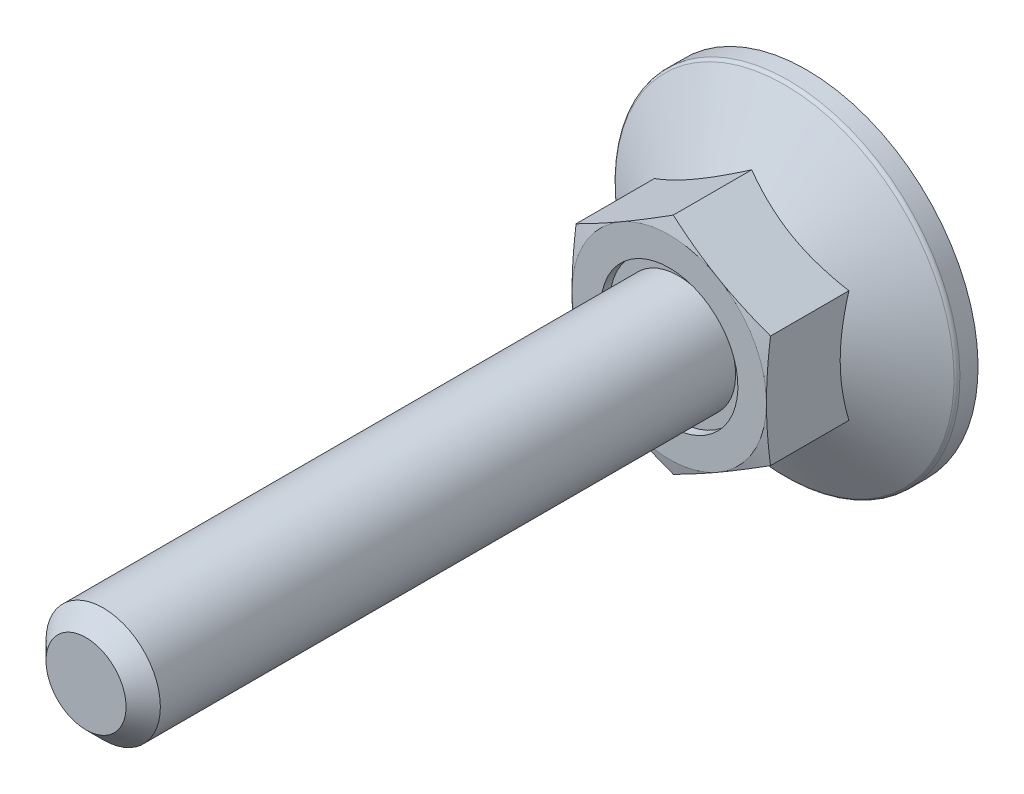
ISO-10303-21;
HEADER;
FILE_DESCRIPTION(('STEP AP214'),'2;1');
FILE_NAME('part.step','',(''),(''),'','','');
FILE_SCHEMA(('AUTOMOTIVE_DESIGN { 1 0 10303 214 1 1 1 1 }'));
ENDSEC;
DATA;
#1=APPLICATION_CONTEXT('core data for automotive mechanical design processes');
#2=APPLICATION_PROTOCOL_DEFINITION('international standard','automotive_design',2000,#1);
#3=PRODUCT_CONTEXT('',#1,'mechanical');
#4=PRODUCT('Part','Part','',(#3));
#5=PRODUCT_RELATED_PRODUCT_CATEGORY('part','',(#4));
#6=PRODUCT_DEFINITION_FORMATION('','',#4);
#7=PRODUCT_DEFINITION_CONTEXT('part definition',#1,'design');
#8=PRODUCT_DEFINITION('design','',#6,#7);
#9=PRODUCT_DEFINITION_SHAPE('','',#8);
#10=(LENGTH_UNIT() NAMED_UNIT(*) SI_UNIT(.MILLI.,.METRE.));
#11=(NAMED_UNIT(*) PLANE_ANGLE_UNIT() SI_UNIT($,.RADIAN.));
#12=(NAMED_UNIT(*) SI_UNIT($,.STERADIAN.) SOLID_ANGLE_UNIT());
#13=UNCERTAINTY_MEASURE_WITH_UNIT(LENGTH_MEASURE(1.E-05),#10,'distance_accuracy_value','');
#14=(GEOMETRIC_REPRESENTATION_CONTEXT(3) GLOBAL_UNCERTAINTY_ASSIGNED_CONTEXT((#13)) GLOBAL_UNIT_ASSIGNED_CONTEXT((#10,
#11,#12)) REPRESENTATION_CONTEXT('',''));
#15=CARTESIAN_POINT('',(0.,0.,0.));
#16=DIRECTION('',(0.,0.,1.));
#17=DIRECTION('',(1.,0.,0.));
#18=AXIS2_PLACEMENT_3D('',#15,#16,#17);
#19=CARTESIAN_POINT('',(0.,0.,11.2));
#20=DIRECTION('',(0.,0.,-1.));
#21=DIRECTION('',(0.,1.,0.));
#22=AXIS2_PLACEMENT_3D('',#19,#20,#21);
#23=PLANE('',#22);
#24=CARTESIAN_POINT('',(0.,0.,11.2));
#25=DIRECTION('',(0.,0.,-1.));
#26=DIRECTION('',(0.,1.,0.));
#27=AXIS2_PLACEMENT_3D('',#24,#25,#26);
#28=CIRCLE('',#27,6.);
#29=CARTESIAN_POINT('',(0.,6.,11.2));
#30=VERTEX_POINT('',#29);
#31=EDGE_CURVE('E108',#30,#30,#28,.T.);
#32=ORIENTED_EDGE('',*,*,#31,.F.);
#33=EDGE_LOOP('',(#32));
#34=FACE_BOUND('',#33,.T.);
#35=CARTESIAN_POINT('',(0.,0.,11.2));
#36=DIRECTION('',(0.,0.,-1.));
#37=DIRECTION('',(0.,1.,0.));
#38=AXIS2_PLACEMENT_3D('',#35,#36,#37);
#39=CIRCLE('',#38,5.);
#40=CARTESIAN_POINT('',(0.,5.,11.2));
#41=VERTEX_POINT('',#40);
#42=EDGE_CURVE('E259',#41,#41,#39,.F.);
#43=ORIENTED_EDGE('',*,*,#42,.F.);
#44=EDGE_LOOP('',(#43));
#45=FACE_BOUND('',#44,.T.);
#46=ADVANCED_FACE('F14',(#34,#45),#23,.F.);
#47=CARTESIAN_POINT('',(0.,9.81495457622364,32.));
#48=DIRECTION('',(0.5,-0.866025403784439,0.));
#49=DIRECTION('',(0.866025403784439,0.5,0.));
#50=AXIS2_PLACEMENT_3D('',#47,#48,#49);
#51=PLANE('',#50);
#52=CARTESIAN_POINT('',(-8.5002,4.90736181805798,4.7935207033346));
#53=CARTESIAN_POINT('',(-8.31336077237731,5.01523349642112,4.85579061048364));
#54=CARTESIAN_POINT('',(-8.1258249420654,5.1235073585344,4.91523445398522));
#55=CARTESIAN_POINT('',(-7.74923024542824,5.34093440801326,5.02769163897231));
#56=CARTESIAN_POINT('',(-7.56017075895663,5.45008795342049,5.08070220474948));
#57=CARTESIAN_POINT('',(-6.9899652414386,5.77929626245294,5.22904336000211));
#58=CARTESIAN_POINT('',(-6.60656835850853,6.00065055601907,5.31341782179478));
#59=CARTESIAN_POINT('',(-6.03282233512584,6.33190297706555,5.41235673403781));
#60=CARTESIAN_POINT('',(-5.84418723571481,6.44081150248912,5.44054155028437));
#61=CARTESIAN_POINT('',(-5.46606397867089,6.65912106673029,5.48780266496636));
#62=CARTESIAN_POINT('',(-5.27657589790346,6.76852206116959,5.5068797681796));
#63=CARTESIAN_POINT('',(-4.8972734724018,6.98751241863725,5.53544197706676));
#64=CARTESIAN_POINT('',(-4.70745974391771,7.09710142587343,5.54493796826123));
#65=CARTESIAN_POINT('',(-4.32765694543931,7.3163806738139,5.55413437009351));
#66=CARTESIAN_POINT('',(-4.13766788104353,7.42607091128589,5.55383508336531));
#67=CARTESIAN_POINT('',(-3.78247698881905,7.63114046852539,5.54412227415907));
#68=CARTESIAN_POINT('',(-3.6172500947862,7.72653426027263,5.53589358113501));
#69=CARTESIAN_POINT('',(-3.28718328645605,7.9170984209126,5.51218750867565));
#70=CARTESIAN_POINT('',(-3.12234339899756,8.01226877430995,5.49670964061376));
#71=CARTESIAN_POINT('',(-2.62846189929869,8.29741139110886,5.43976812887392));
#72=CARTESIAN_POINT('',(-2.30029449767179,8.48687892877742,5.38780368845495));
#73=CARTESIAN_POINT('',(-1.64047857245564,8.86782383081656,5.25789180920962));
#74=CARTESIAN_POINT('',(-1.30891425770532,9.05925257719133,5.17939367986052));
#75=CARTESIAN_POINT('',(-0.650730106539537,9.43925537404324,5.00123540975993));
#76=CARTESIAN_POINT('',(-0.32410184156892,9.62783429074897,4.90161711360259));
#77=CARTESIAN_POINT('',(0.000200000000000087,9.81507004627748,4.7935207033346));
#78=B_SPLINE_CURVE_WITH_KNOTS('',3,(#52,#53,#54,#55,#56,#57,#58,#59,#60,#61,#62,#63,#64,#65,#66,
#67,#68,#69,#70,#71,#72,#73,#74,#75,#76,#77),.UNSPECIFIED.,.F.,.F.,(4,2,2,2,2,2,2,2,2,2,2,2,4),
(0.,0.673596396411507,1.34748239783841,2.69805431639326,3.356799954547,4.01548737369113,
4.67342558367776,5.33134346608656,5.90409556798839,6.47688628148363,7.62328361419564,
8.79510569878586,9.9646274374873),.UNSPECIFIED.);
#79=CARTESIAN_POINT('',(-8.5,4.90747728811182,4.79358737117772));
#80=VERTEX_POINT('',#79);
#81=CARTESIAN_POINT('',(0.,9.81495457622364,4.79358737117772));
#82=VERTEX_POINT('',#81);
#83=EDGE_CURVE('E97',#80,#82,#78,.T.);
#84=ORIENTED_EDGE('',*,*,#83,.F.);
#85=DIRECTION('',(0.,0.,-1.));
#86=VECTOR('',#85,1.);
#87=CARTESIAN_POINT('',(-8.5,4.90747728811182,32.));
#88=LINE('',#87,#86);
#89=CARTESIAN_POINT('',(-8.5,4.90747728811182,11.6476589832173));
#90=VERTEX_POINT('',#89);
#91=EDGE_CURVE('E86',#90,#80,#88,.T.);
#92=ORIENTED_EDGE('',*,*,#91,.F.);
#93=CARTESIAN_POINT('',(0.000200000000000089,9.81507004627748,11.6476280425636));
#94=CARTESIAN_POINT('',(-0.352800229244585,9.61126526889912,11.7022599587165));
#95=CARTESIAN_POINT('',(-0.706440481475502,9.40709097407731,11.7518566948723));
#96=CARTESIAN_POINT('',(-1.41496987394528,8.99802133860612,11.8389934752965));
#97=CARTESIAN_POINT('',(-1.76985946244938,8.79312573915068,11.8765286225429));
#98=CARTESIAN_POINT('',(-2.47873586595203,8.38385575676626,11.9373509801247));
#99=CARTESIAN_POINT('',(-2.83271788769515,8.17948414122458,11.9607107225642));
#100=CARTESIAN_POINT('',(-3.5411333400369,7.77048028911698,11.9920337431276));
#101=CARTESIAN_POINT('',(-3.89556667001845,7.56584811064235,12.));
#102=CARTESIAN_POINT('',(-4.60443332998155,7.15658375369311,12.));
#103=CARTESIAN_POINT('',(-4.9588666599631,6.95195157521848,11.9920337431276));
#104=CARTESIAN_POINT('',(-5.66728211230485,6.54294772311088,11.9607107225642));
#105=CARTESIAN_POINT('',(-6.02126413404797,6.33857610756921,11.9373509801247));
#106=CARTESIAN_POINT('',(-6.73014053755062,5.92930612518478,11.8765286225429));
#107=CARTESIAN_POINT('',(-7.08503012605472,5.72441052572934,11.8389934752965));
#108=CARTESIAN_POINT('',(-7.7935595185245,5.31534089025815,11.7518566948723));
#109=CARTESIAN_POINT('',(-8.14719977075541,5.11116659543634,11.7022599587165));
#110=CARTESIAN_POINT('',(-8.5002,4.90736181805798,11.6476280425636));
#111=B_SPLINE_CURVE_WITH_KNOTS('',3,(#93,#94,#95,#96,#97,#98,#99,#100,#101,#102,#103,#104,#105,
#106,#107,#108,#109,#110),.UNSPECIFIED.,.F.,.F.,(4,2,2,2,2,2,2,2,4),(0.,1.23382789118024,
2.46815608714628,3.69611406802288,4.92383440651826,6.15155474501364,7.37951272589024,
8.61384092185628,9.84766881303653),.UNSPECIFIED.);
#112=CARTESIAN_POINT('',(-4.25,7.36121593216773,12.));
#113=VERTEX_POINT('',#112);
#114=EDGE_CURVE('E186',#113,#90,#111,.T.);
#115=ORIENTED_EDGE('',*,*,#114,.F.);
#116=CARTESIAN_POINT('',(0.,9.81495457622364,11.6476589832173));
#117=VERTEX_POINT('',#116);
#118=EDGE_CURVE('E318',#117,#113,#111,.T.);
#119=ORIENTED_EDGE('',*,*,#118,.F.);
#120=DIRECTION('',(0.,0.,-1.));
#121=VECTOR('',#120,1.);
#122=CARTESIAN_POINT('',(0.,9.81495457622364,32.));
#123=LINE('',#122,#121);
#124=EDGE_CURVE('E101',#117,#82,#123,.T.);
#125=ORIENTED_EDGE('',*,*,#124,.T.);
#126=EDGE_LOOP('',(#84,#92,#115,#119,#125));
#127=FACE_BOUND('',#126,.T.);
#128=ADVANCED_FACE('F100',(#127),#51,.F.);
#129=CARTESIAN_POINT('',(8.5,4.90747728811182,32.));
#130=DIRECTION('',(-0.5,-0.866025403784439,0.));
#131=DIRECTION('',(0.866025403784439,-0.5,0.));
#132=AXIS2_PLACEMENT_3D('',#129,#130,#131);
#133=PLANE('',#132);
#134=CARTESIAN_POINT('',(-0.0002,9.81507004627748,4.7935207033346));
#135=CARTESIAN_POINT('',(0.186639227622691,9.70719836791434,4.85579061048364));
#136=CARTESIAN_POINT('',(0.374175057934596,9.59892450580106,4.91523445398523));
#137=CARTESIAN_POINT('',(0.750769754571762,9.3814974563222,5.02769163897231));
#138=CARTESIAN_POINT('',(0.939829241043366,9.27234391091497,5.08070220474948));
#139=CARTESIAN_POINT('',(1.5100347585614,8.94313560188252,5.22904336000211));
#140=CARTESIAN_POINT('',(1.89343164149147,8.72178130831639,5.31341782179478));
#141=CARTESIAN_POINT('',(2.46717766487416,8.39052888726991,5.41235673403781));
#142=CARTESIAN_POINT('',(2.65581276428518,8.28162036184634,5.44054155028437));
#143=CARTESIAN_POINT('',(3.03393602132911,8.06331079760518,5.48780266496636));
#144=CARTESIAN_POINT('',(3.22342410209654,7.95390980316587,5.5068797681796));
#145=CARTESIAN_POINT('',(3.6027265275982,7.73491944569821,5.53544197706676));
#146=CARTESIAN_POINT('',(3.79254025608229,7.62533043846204,5.54493796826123));
#147=CARTESIAN_POINT('',(4.17234305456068,7.40605119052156,5.55413437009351));
#148=CARTESIAN_POINT('',(4.36233211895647,7.29636095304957,5.55383508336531));
#149=CARTESIAN_POINT('',(4.71752301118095,7.09129139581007,5.54412227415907));
#150=CARTESIAN_POINT('',(4.8827499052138,6.99589760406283,5.53589358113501));
#151=CARTESIAN_POINT('',(5.21281671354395,6.80533344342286,5.51218750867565));
#152=CARTESIAN_POINT('',(5.37765660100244,6.71016309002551,5.49670964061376));
#153=CARTESIAN_POINT('',(5.87153810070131,6.42502047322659,5.43976812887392));
#154=CARTESIAN_POINT('',(6.19970550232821,6.23555293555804,5.38780368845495));
#155=CARTESIAN_POINT('',(6.85952142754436,5.8546080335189,5.25789180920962));
#156=CARTESIAN_POINT('',(7.19108574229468,5.66317928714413,5.17939367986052));
#157=CARTESIAN_POINT('',(7.84926989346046,5.28317649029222,5.00123540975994));
#158=CARTESIAN_POINT('',(8.17589815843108,5.09459757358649,4.90161711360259));
#159=CARTESIAN_POINT('',(8.5002,4.90736181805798,4.7935207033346));
#160=B_SPLINE_CURVE_WITH_KNOTS('',3,(#134,#135,#136,#137,#138,#139,#140,#141,#142,#143,#144,
#145,#146,#147,#148,#149,#150,#151,#152,#153,#154,#155,#156,#157,#158,#159),.UNSPECIFIED.,.F.,
.F.,(4,2,2,2,2,2,2,2,2,2,2,2,4),(0.,0.673596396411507,1.34748239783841,2.69805431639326,
3.356799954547,4.01548737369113,4.67342558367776,5.33134346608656,5.90409556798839,
6.47688628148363,7.62328361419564,8.79510569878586,9.9646274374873),.UNSPECIFIED.);
#161=CARTESIAN_POINT('',(8.5,4.90747728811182,4.79358737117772));
#162=VERTEX_POINT('',#161);
#163=EDGE_CURVE('E29',#82,#162,#160,.T.);
#164=ORIENTED_EDGE('',*,*,#163,.F.);
#165=ORIENTED_EDGE('',*,*,#124,.F.);
#166=CARTESIAN_POINT('',(8.5002,4.90736181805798,11.6476280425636));
#167=CARTESIAN_POINT('',(8.14719977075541,5.11116659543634,11.7022599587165));
#168=CARTESIAN_POINT('',(7.7935595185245,5.31534089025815,11.7518566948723));
#169=CARTESIAN_POINT('',(7.08503012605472,5.72441052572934,11.8389934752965));
#170=CARTESIAN_POINT('',(6.73014053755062,5.92930612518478,11.8765286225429));
#171=CARTESIAN_POINT('',(6.02126413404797,6.33857610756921,11.9373509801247));
#172=CARTESIAN_POINT('',(5.66728211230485,6.54294772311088,11.9607107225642));
#173=CARTESIAN_POINT('',(4.9588666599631,6.95195157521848,11.9920337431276));
#174=CARTESIAN_POINT('',(4.60443332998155,7.15658375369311,12.));
#175=CARTESIAN_POINT('',(3.89556667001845,7.56584811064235,12.));
#176=CARTESIAN_POINT('',(3.5411333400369,7.77048028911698,11.9920337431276));
#177=CARTESIAN_POINT('',(2.83271788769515,8.17948414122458,11.9607107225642));
#178=CARTESIAN_POINT('',(2.47873586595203,8.38385575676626,11.9373509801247));
#179=CARTESIAN_POINT('',(1.76985946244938,8.79312573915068,11.8765286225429));
#180=CARTESIAN_POINT('',(1.41496987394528,8.99802133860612,11.8389934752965));
#181=CARTESIAN_POINT('',(0.706440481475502,9.40709097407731,11.7518566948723));
#182=CARTESIAN_POINT('',(0.352800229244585,9.61126526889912,11.7022599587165));
#183=CARTESIAN_POINT('',(-0.000200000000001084,9.81507004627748,11.6476280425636));
#184=B_SPLINE_CURVE_WITH_KNOTS('',3,(#166,#167,#168,#169,#170,#171,#172,#173,#174,#175,#176,
#177,#178,#179,#180,#181,#182,#183),.UNSPECIFIED.,.F.,.F.,(4,2,2,2,2,2,2,2,4),(0.,
1.23382789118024,2.46815608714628,3.69611406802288,4.92383440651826,6.15155474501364,
7.37951272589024,8.61384092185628,9.84766881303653),.UNSPECIFIED.);
#185=CARTESIAN_POINT('',(4.25,7.36121593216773,12.));
#186=VERTEX_POINT('',#185);
#187=EDGE_CURVE('E177',#186,#117,#184,.T.);
#188=ORIENTED_EDGE('',*,*,#187,.F.);
#189=CARTESIAN_POINT('',(8.5,4.90747728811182,11.6476589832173));
#190=VERTEX_POINT('',#189);
#191=EDGE_CURVE('E184',#190,#186,#184,.T.);
#192=ORIENTED_EDGE('',*,*,#191,.F.);
#193=DIRECTION('',(0.,0.,-1.));
#194=VECTOR('',#193,1.);
#195=CARTESIAN_POINT('',(8.5,4.90747728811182,32.));
#196=LINE('',#195,#194);
#197=EDGE_CURVE('E216',#190,#162,#196,.T.);
#198=ORIENTED_EDGE('',*,*,#197,.T.);
#199=EDGE_LOOP('',(#164,#165,#188,#192,#198));
#200=FACE_BOUND('',#199,.T.);
#201=ADVANCED_FACE('F192',(#200),#133,.F.);
#202=CARTESIAN_POINT('',(8.5,-4.90747728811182,32.));
#203=DIRECTION('',(-1.,0.,0.));
#204=DIRECTION('',(0.,-1.,0.));
#205=AXIS2_PLACEMENT_3D('',#202,#203,#204);
#206=PLANE('',#205);
#207=CARTESIAN_POINT('',(8.5,13.0314294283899,1.47752704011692));
#208=CARTESIAN_POINT('',(8.5,12.6612665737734,1.65647774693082));
#209=CARTESIAN_POINT('',(8.5,12.290237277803,1.83366776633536));
#210=CARTESIAN_POINT('',(8.5,11.5459841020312,2.1835324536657));
#211=CARTESIAN_POINT('',(8.5,11.1727598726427,2.3562063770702));
#212=CARTESIAN_POINT('',(8.5,10.4216603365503,2.69694543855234));
#213=CARTESIAN_POINT('',(8.5,10.0437706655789,2.86497902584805));
#214=CARTESIAN_POINT('',(8.5,9.2849306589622,3.19396010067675));
#215=CARTESIAN_POINT('',(8.5,8.90398047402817,3.35490793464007));
#216=CARTESIAN_POINT('',(8.5,8.12702308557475,3.67249615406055));
#217=CARTESIAN_POINT('',(8.5,7.73090483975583,3.82886642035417));
#218=CARTESIAN_POINT('',(8.5,6.93398073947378,4.12940330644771));
#219=CARTESIAN_POINT('',(8.5,6.53317435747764,4.27356853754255));
#220=CARTESIAN_POINT('',(8.5,5.72703031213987,4.54580160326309));
#221=CARTESIAN_POINT('',(8.5,5.32170421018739,4.67390329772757));
#222=CARTESIAN_POINT('',(8.5,4.50525785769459,4.90980359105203));
#223=CARTESIAN_POINT('',(8.5,4.09413952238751,5.01760873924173));
#224=CARTESIAN_POINT('',(8.5,3.26789885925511,5.20711197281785));
#225=CARTESIAN_POINT('',(8.5,2.85280627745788,5.28893618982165));
#226=CARTESIAN_POINT('',(8.5,2.22651264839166,5.38853539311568));
#227=CARTESIAN_POINT('',(8.5,2.01712321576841,5.41788026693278));
#228=CARTESIAN_POINT('',(8.5,1.59735566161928,5.46827917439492));
#229=CARTESIAN_POINT('',(8.5,1.38697763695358,5.48933400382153));
#230=CARTESIAN_POINT('',(8.5,0.968196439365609,5.52247691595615));
#231=CARTESIAN_POINT('',(8.5,0.759802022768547,5.53467524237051));
#232=CARTESIAN_POINT('',(8.5,0.342684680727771,5.55026003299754));
#233=CARTESIAN_POINT('',(8.5,0.133961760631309,5.5536466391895));
#234=CARTESIAN_POINT('',(8.5,-0.283445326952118,5.55152742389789));
#235=CARTESIAN_POINT('',(8.5,-0.492129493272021,5.546021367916));
#236=CARTESIAN_POINT('',(8.5,-0.909085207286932,5.52624824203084));
#237=CARTESIAN_POINT('',(8.5,-1.11735673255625,5.51198070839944));
#238=CARTESIAN_POINT('',(8.5,-1.62231800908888,5.46706351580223));
#239=CARTESIAN_POINT('',(8.5,-1.91862399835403,5.43201243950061));
#240=CARTESIAN_POINT('',(8.5,-2.50892471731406,5.34612267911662));
#241=CARTESIAN_POINT('',(8.5,-2.80291910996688,5.29528173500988));
#242=CARTESIAN_POINT('',(8.5,-3.68114216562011,5.12178025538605));
#243=CARTESIAN_POINT('',(8.5,-4.26128126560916,4.97817413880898));
#244=CARTESIAN_POINT('',(8.5,-5.12903133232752,4.73045572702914));
#245=CARTESIAN_POINT('',(8.5,-5.42116721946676,4.64129591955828));
#246=CARTESIAN_POINT('',(8.5,-6.0025970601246,4.45406394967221));
#247=CARTESIAN_POINT('',(8.5,-6.29189099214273,4.35599171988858));
#248=CARTESIAN_POINT('',(8.5,-6.86774141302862,4.15248019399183));
#249=CARTESIAN_POINT('',(8.5,-7.15429879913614,4.0470434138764));
#250=CARTESIAN_POINT('',(8.5,-7.72505625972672,3.83000899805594));
#251=CARTESIAN_POINT('',(8.5,-8.00925638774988,3.71841150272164));
#252=CARTESIAN_POINT('',(8.5,-8.7865968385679,3.40502511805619));
#253=CARTESIAN_POINT('',(8.5,-9.2776226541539,3.197996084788));
#254=CARTESIAN_POINT('',(8.5,-10.2546964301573,2.77246752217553));
#255=CARTESIAN_POINT('',(8.5,-10.7407438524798,2.55396676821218));
#256=CARTESIAN_POINT('',(8.5,-11.7090438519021,2.108282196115));
#257=CARTESIAN_POINT('',(8.5,-12.1912949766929,1.88109523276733));
#258=CARTESIAN_POINT('',(8.5,-13.1526185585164,1.42016244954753));
#259=CARTESIAN_POINT('',(8.5,-13.6316911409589,1.18641689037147));
#260=CARTESIAN_POINT('',(8.5,-14.588034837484,0.713462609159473));
#261=CARTESIAN_POINT('',(8.5,-15.0653020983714,0.47424611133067));
#262=CARTESIAN_POINT('',(8.5,-16.0177905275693,-0.00822936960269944));
#263=CARTESIAN_POINT('',(8.5,-16.4930116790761,-0.251488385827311));
#264=CARTESIAN_POINT('',(8.5,-17.4416812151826,-0.741191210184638));
#265=CARTESIAN_POINT('',(8.5,-17.9151299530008,-0.987634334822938));
#266=CARTESIAN_POINT('',(8.5,-18.8606492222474,-1.48315179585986));
#267=CARTESIAN_POINT('',(8.5,-19.3327197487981,-1.73222614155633));
#268=CARTESIAN_POINT('',(8.5,-20.6461392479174,-2.42904815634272));
#269=CARTESIAN_POINT('',(8.5,-21.4862394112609,-2.87914918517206));
#270=CARTESIAN_POINT('',(8.5,-23.1638169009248,-3.78432075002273));
#271=CARTESIAN_POINT('',(8.5,-24.0012940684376,-4.23939157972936));
#272=CARTESIAN_POINT('',(8.5,-25.671623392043,-5.15180725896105));
#273=CARTESIAN_POINT('',(8.5,-26.5044818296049,-5.60914061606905));
#274=CARTESIAN_POINT('',(8.5,-27.7525740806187,-6.29723391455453));
#275=CARTESIAN_POINT('',(8.5,-28.1683903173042,-6.52693873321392));
#276=CARTESIAN_POINT('',(8.5,-28.9996764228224,-6.98697325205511));
#277=CARTESIAN_POINT('',(8.5,-29.4151462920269,-7.21730295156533));
#278=CARTESIAN_POINT('',(8.5,-29.8304643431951,-7.44790614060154));
#279=B_SPLINE_CURVE_WITH_KNOTS('',3,(#207,#208,#209,#210,#211,#212,#213,#214,#215,#216,#217,
#218,#219,#220,#221,#222,#223,#224,#225,#226,#227,#228,#229,#230,#231,#232,#233,#234,#235,#236,
#237,#238,#239,#240,#241,#242,#243,#244,#245,#246,#247,#248,#249,#250,#251,#252,#253,#254,#255,
#256,#257,#258,#259,#260,#261,#262,#263,#264,#265,#266,#267,#268,#269,#270,#271,#272,#273,#274,
#275,#276,#277,#278),.UNSPECIFIED.,.F.,.F.,(4,2,2,2,2,2,2,2,2,2,2,2,2,2,2,2,2,2,2,2,2,2,2,2,2,2,
2,2,2,2,2,2,2,2,2,4),(0.,1.23346428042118,2.46713064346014,3.70776702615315,4.94834268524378,
6.22578289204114,7.5033682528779,8.77821366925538,10.0526470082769,11.32079515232,
11.9549638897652,12.5890717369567,13.2151443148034,13.8412068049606,14.4672858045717,
15.0933979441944,15.9880059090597,16.8827419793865,18.6732029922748,19.5894472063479,
20.5056983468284,21.4216379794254,22.3375567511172,23.9359919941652,25.5345982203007,
27.1337888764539,28.7329160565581,30.3344778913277,31.9360528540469,33.5372895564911,
35.1385319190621,37.9977422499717,40.8571224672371,43.7075995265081,45.1327331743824,
46.5578652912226),.UNSPECIFIED.);
#280=CARTESIAN_POINT('',(8.5,-4.90747728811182,4.79358737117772));
#281=VERTEX_POINT('',#280);
#282=EDGE_CURVE('E37',#162,#281,#279,.T.);
#283=ORIENTED_EDGE('',*,*,#282,.F.);
#284=ORIENTED_EDGE('',*,*,#197,.F.);
#285=CARTESIAN_POINT('',(8.5,12.9820891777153,10.1197370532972));
#286=CARTESIAN_POINT('',(8.5,12.5964686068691,10.2061594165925));
#287=CARTESIAN_POINT('',(8.5,12.2106068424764,10.2915248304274));
#288=CARTESIAN_POINT('',(8.5,11.4382824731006,10.4595712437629));
#289=CARTESIAN_POINT('',(8.5,11.0518198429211,10.5422521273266));
#290=CARTESIAN_POINT('',(8.5,10.2778290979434,10.7044309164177));
#291=CARTESIAN_POINT('',(8.5,9.89030030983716,10.7839256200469));
#292=CARTESIAN_POINT('',(8.5,9.11443612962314,10.9388739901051));
#293=CARTESIAN_POINT('',(8.5,8.72610074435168,11.0143276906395));
#294=CARTESIAN_POINT('',(8.5,7.95158013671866,11.159650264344));
#295=CARTESIAN_POINT('',(8.5,7.56540239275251,11.2295587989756));
#296=CARTESIAN_POINT('',(8.5,6.79199352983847,11.3632725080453));
#297=CARTESIAN_POINT('',(8.5,6.40476243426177,11.4270778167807));
#298=CARTESIAN_POINT('',(8.5,5.62917169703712,11.54714843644));
#299=CARTESIAN_POINT('',(8.5,5.24081220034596,11.6034146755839));
#300=CARTESIAN_POINT('',(8.5,4.46285737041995,11.70674908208));
#301=CARTESIAN_POINT('',(8.5,4.07326203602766,11.7538172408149));
#302=CARTESIAN_POINT('',(8.5,3.28844017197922,11.8374226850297));
#303=CARTESIAN_POINT('',(8.5,2.89320002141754,11.8738340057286));
#304=CARTESIAN_POINT('',(8.5,2.10172608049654,11.9336139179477));
#305=CARTESIAN_POINT('',(8.5,1.70549231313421,11.9569828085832));
#306=CARTESIAN_POINT('',(8.5,0.91260591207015,11.9893148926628));
#307=CARTESIAN_POINT('',(8.5,0.515953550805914,11.9982846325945));
#308=CARTESIAN_POINT('',(8.5,-0.277408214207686,12.0012669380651));
#309=CARTESIAN_POINT('',(8.5,-0.674117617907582,11.9952795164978));
#310=CARTESIAN_POINT('',(8.5,-1.46847963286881,11.9686842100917));
#311=CARTESIAN_POINT('',(8.5,-1.86613043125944,11.9480232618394));
#312=CARTESIAN_POINT('',(8.5,-2.66049684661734,11.8932602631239));
#313=CARTESIAN_POINT('',(8.5,-3.05721244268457,11.8591579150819));
#314=CARTESIAN_POINT('',(8.5,-3.84970511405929,11.7792347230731));
#315=CARTESIAN_POINT('',(8.5,-4.24548140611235,11.7334062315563));
#316=CARTESIAN_POINT('',(8.5,-5.03576028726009,11.6319377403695));
#317=CARTESIAN_POINT('',(8.5,-5.43026287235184,11.5762977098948));
#318=CARTESIAN_POINT('',(8.5,-6.19195385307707,11.4609360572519));
#319=CARTESIAN_POINT('',(8.5,-6.55922094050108,11.4017287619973));
#320=CARTESIAN_POINT('',(8.5,-7.29278719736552,11.2775674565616));
#321=CARTESIAN_POINT('',(8.5,-7.65908634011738,11.2126132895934));
#322=CARTESIAN_POINT('',(8.5,-8.39085027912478,11.078008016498));
#323=CARTESIAN_POINT('',(8.5,-8.75631499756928,11.0083564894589));
#324=CARTESIAN_POINT('',(8.5,-9.48649515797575,10.8652200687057));
#325=CARTESIAN_POINT('',(8.5,-9.85121059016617,10.7917351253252));
#326=CARTESIAN_POINT('',(8.5,-10.5800753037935,10.6416087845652));
#327=CARTESIAN_POINT('',(8.5,-10.944224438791,10.5649666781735));
#328=CARTESIAN_POINT('',(8.5,-11.6719684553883,10.4090909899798));
#329=CARTESIAN_POINT('',(8.5,-12.0355633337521,10.3298573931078));
#330=CARTESIAN_POINT('',(8.5,-13.1255915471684,10.0889686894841));
#331=CARTESIAN_POINT('',(8.5,-13.8513178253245,9.92411536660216));
#332=CARTESIAN_POINT('',(8.5,-15.2942598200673,9.59010912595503));
#333=CARTESIAN_POINT('',(8.5,-16.0114890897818,9.42101437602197));
#334=CARTESIAN_POINT('',(8.5,-17.4449475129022,9.07858755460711));
#335=CARTESIAN_POINT('',(8.5,-18.1611766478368,8.90525540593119));
#336=CARTESIAN_POINT('',(8.5,-19.5919856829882,8.5556799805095));
#337=CARTESIAN_POINT('',(8.5,-20.306566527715,8.37944056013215));
#338=CARTESIAN_POINT('',(8.5,-21.7351057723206,8.02455520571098));
#339=CARTESIAN_POINT('',(8.5,-22.4490641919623,7.8459093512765));
#340=CARTESIAN_POINT('',(8.5,-23.1628057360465,7.66641079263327));
#341=B_SPLINE_CURVE_WITH_KNOTS('',3,(#285,#286,#287,#288,#289,#290,#291,#292,#293,#294,#295,
#296,#297,#298,#299,#300,#301,#302,#303,#304,#305,#306,#307,#308,#309,#310,#311,#312,#313,#314,
#315,#316,#317,#318,#319,#320,#321,#322,#323,#324,#325,#326,#327,#328,#329,#330,#331,#332,#333,
#334,#335,#336,#337,#338,#339,#340),.UNSPECIFIED.,.F.,.F.,(4,2,2,2,2,2,2,2,2,2,2,2,2,2,2,2,2,2,
2,2,2,2,2,2,2,2,2,4),(0.,1.18556310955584,2.37117735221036,3.55795462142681,4.74472187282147,
5.92204594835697,7.09934411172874,8.27649719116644,9.45365137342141,10.6442044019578,
11.8347301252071,13.0247144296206,14.2146977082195,15.4090063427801,16.6033414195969,
17.7984574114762,18.9935771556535,20.1095500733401,21.2255534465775,22.3416569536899,
23.4577749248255,24.5741449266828,25.6905214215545,27.9231231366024,30.1337863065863,
32.3444897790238,34.5524651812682,36.7603677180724),.UNSPECIFIED.);
#342=CARTESIAN_POINT('',(8.5,0.,12.));
#343=VERTEX_POINT('',#342);
#344=EDGE_CURVE('E170',#343,#190,#341,.F.);
#345=ORIENTED_EDGE('',*,*,#344,.F.);
#346=CARTESIAN_POINT('',(8.5,-4.90747728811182,11.6476589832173));
#347=VERTEX_POINT('',#346);
#348=EDGE_CURVE('E185',#347,#343,#341,.F.);
#349=ORIENTED_EDGE('',*,*,#348,.F.);
#350=DIRECTION('',(0.,0.,-1.));
#351=VECTOR('',#350,1.);
#352=CARTESIAN_POINT('',(8.5,-4.90747728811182,32.));
#353=LINE('',#352,#351);
#354=EDGE_CURVE('E218',#347,#281,#353,.T.);
#355=ORIENTED_EDGE('',*,*,#354,.T.);
#356=EDGE_LOOP('',(#283,#284,#345,#349,#355));
#357=FACE_BOUND('',#356,.T.);
#358=ADVANCED_FACE('F195',(#357),#206,.F.);
#359=CARTESIAN_POINT('',(0.,-9.81495457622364,32.));
#360=DIRECTION('',(-0.5,0.866025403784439,0.));
#361=DIRECTION('',(-0.866025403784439,-0.5,0.));
#362=AXIS2_PLACEMENT_3D('',#359,#360,#361);
#363=PLANE('',#362);
#364=CARTESIAN_POINT('',(8.5002,-4.90736181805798,4.7935207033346));
#365=CARTESIAN_POINT('',(8.31336077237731,-5.01523349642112,4.85579061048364));
#366=CARTESIAN_POINT('',(8.1258249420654,-5.1235073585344,4.91523445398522));
#367=CARTESIAN_POINT('',(7.74923024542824,-5.34093440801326,5.02769163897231));
#368=CARTESIAN_POINT('',(7.56017075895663,-5.45008795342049,5.08070220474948));
#369=CARTESIAN_POINT('',(6.9899652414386,-5.77929626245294,5.22904336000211));
#370=CARTESIAN_POINT('',(6.60656835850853,-6.00065055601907,5.31341782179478));
#371=CARTESIAN_POINT('',(6.03282233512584,-6.33190297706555,5.41235673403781));
#372=CARTESIAN_POINT('',(5.84418723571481,-6.44081150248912,5.44054155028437));
#373=CARTESIAN_POINT('',(5.46606397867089,-6.65912106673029,5.48780266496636));
#374=CARTESIAN_POINT('',(5.27657589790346,-6.76852206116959,5.5068797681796));
#375=CARTESIAN_POINT('',(4.8972734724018,-6.98751241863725,5.53544197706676));
#376=CARTESIAN_POINT('',(4.70745974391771,-7.09710142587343,5.54493796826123));
#377=CARTESIAN_POINT('',(4.32765694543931,-7.3163806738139,5.55413437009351));
#378=CARTESIAN_POINT('',(4.13766788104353,-7.42607091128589,5.55383508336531));
#379=CARTESIAN_POINT('',(3.78247698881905,-7.63114046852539,5.54412227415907));
#380=CARTESIAN_POINT('',(3.6172500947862,-7.72653426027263,5.53589358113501));
#381=CARTESIAN_POINT('',(3.28718328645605,-7.9170984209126,5.51218750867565));
#382=CARTESIAN_POINT('',(3.12234339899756,-8.01226877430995,5.49670964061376));
#383=CARTESIAN_POINT('',(2.62846189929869,-8.29741139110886,5.43976812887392));
#384=CARTESIAN_POINT('',(2.30029449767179,-8.48687892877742,5.38780368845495));
#385=CARTESIAN_POINT('',(1.64047857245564,-8.86782383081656,5.25789180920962));
#386=CARTESIAN_POINT('',(1.30891425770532,-9.05925257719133,5.17939367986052));
#387=CARTESIAN_POINT('',(0.650730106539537,-9.43925537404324,5.00123540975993));
#388=CARTESIAN_POINT('',(0.32410184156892,-9.62783429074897,4.90161711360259));
#389=CARTESIAN_POINT('',(-0.000200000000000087,-9.81507004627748,4.7935207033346));
#390=B_SPLINE_CURVE_WITH_KNOTS('',3,(#364,#365,#366,#367,#368,#369,#370,#371,#372,#373,#374,
#375,#376,#377,#378,#379,#380,#381,#382,#383,#384,#385,#386,#387,#388,#389),.UNSPECIFIED.,.F.,
.F.,(4,2,2,2,2,2,2,2,2,2,2,2,4),(0.,0.673596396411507,1.34748239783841,2.69805431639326,
3.356799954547,4.01548737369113,4.67342558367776,5.33134346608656,5.90409556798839,
6.47688628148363,7.62328361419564,8.79510569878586,9.9646274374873),.UNSPECIFIED.);
#391=CARTESIAN_POINT('',(0.,-9.81495457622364,4.79358737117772));
#392=VERTEX_POINT('',#391);
#393=EDGE_CURVE('E276',#281,#392,#390,.T.);
#394=ORIENTED_EDGE('',*,*,#393,.F.);
#395=ORIENTED_EDGE('',*,*,#354,.F.);
#396=CARTESIAN_POINT('',(-0.000200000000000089,-9.81507004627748,11.6476280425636));
#397=CARTESIAN_POINT('',(0.352800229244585,-9.61126526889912,11.7022599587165));
#398=CARTESIAN_POINT('',(0.706440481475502,-9.40709097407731,11.7518566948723));
#399=CARTESIAN_POINT('',(1.41496987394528,-8.99802133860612,11.8389934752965));
#400=CARTESIAN_POINT('',(1.76985946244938,-8.79312573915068,11.8765286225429));
#401=CARTESIAN_POINT('',(2.47873586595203,-8.38385575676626,11.9373509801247));
#402=CARTESIAN_POINT('',(2.83271788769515,-8.17948414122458,11.9607107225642));
#403=CARTESIAN_POINT('',(3.5411333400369,-7.77048028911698,11.9920337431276));
#404=CARTESIAN_POINT('',(3.89556667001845,-7.56584811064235,12.));
#405=CARTESIAN_POINT('',(4.60443332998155,-7.15658375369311,12.));
#406=CARTESIAN_POINT('',(4.9588666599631,-6.95195157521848,11.9920337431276));
#407=CARTESIAN_POINT('',(5.66728211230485,-6.54294772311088,11.9607107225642));
#408=CARTESIAN_POINT('',(6.02126413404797,-6.33857610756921,11.9373509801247));
#409=CARTESIAN_POINT('',(6.73014053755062,-5.92930612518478,11.8765286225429));
#410=CARTESIAN_POINT('',(7.08503012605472,-5.72441052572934,11.8389934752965));
#411=CARTESIAN_POINT('',(7.7935595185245,-5.31534089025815,11.7518566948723));
#412=CARTESIAN_POINT('',(8.14719977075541,-5.11116659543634,11.7022599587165));
#413=CARTESIAN_POINT('',(8.5002,-4.90736181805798,11.6476280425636));
#414=B_SPLINE_CURVE_WITH_KNOTS('',3,(#396,#397,#398,#399,#400,#401,#402,#403,#404,#405,#406,
#407,#408,#409,#410,#411,#412,#413),.UNSPECIFIED.,.F.,.F.,(4,2,2,2,2,2,2,2,4),(0.,
1.23382789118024,2.46815608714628,3.69611406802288,4.92383440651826,6.15155474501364,
7.37951272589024,8.61384092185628,9.84766881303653),.UNSPECIFIED.);
#415=CARTESIAN_POINT('',(4.25,-7.36121593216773,12.));
#416=VERTEX_POINT('',#415);
#417=EDGE_CURVE('E164',#416,#347,#414,.T.);
#418=ORIENTED_EDGE('',*,*,#417,.F.);
#419=CARTESIAN_POINT('',(0.,-9.81495457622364,11.6476589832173));
#420=VERTEX_POINT('',#419);
#421=EDGE_CURVE('E299',#420,#416,#414,.T.);
#422=ORIENTED_EDGE('',*,*,#421,.F.);
#423=DIRECTION('',(0.,0.,-1.));
#424=VECTOR('',#423,1.);
#425=CARTESIAN_POINT('',(0.,-9.81495457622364,32.));
#426=LINE('',#425,#424);
#427=EDGE_CURVE('E220',#420,#392,#426,.T.);
#428=ORIENTED_EDGE('',*,*,#427,.T.);
#429=EDGE_LOOP('',(#394,#395,#418,#422,#428));
#430=FACE_BOUND('',#429,.T.);
#431=ADVANCED_FACE('F281',(#430),#363,.F.);
#432=CARTESIAN_POINT('',(-8.5,-4.90747728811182,32.));
#433=DIRECTION('',(0.5,0.866025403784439,0.));
#434=DIRECTION('',(-0.866025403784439,0.5,0.));
#435=AXIS2_PLACEMENT_3D('',#432,#433,#434);
#436=PLANE('',#435);
#437=CARTESIAN_POINT('',(0.0002,-9.81507004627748,4.7935207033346));
#438=CARTESIAN_POINT('',(-0.186639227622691,-9.70719836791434,4.85579061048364));
#439=CARTESIAN_POINT('',(-0.374175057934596,-9.59892450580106,4.91523445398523));
#440=CARTESIAN_POINT('',(-0.750769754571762,-9.3814974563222,5.02769163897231));
#441=CARTESIAN_POINT('',(-0.939829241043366,-9.27234391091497,5.08070220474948));
#442=CARTESIAN_POINT('',(-1.5100347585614,-8.94313560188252,5.22904336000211));
#443=CARTESIAN_POINT('',(-1.89343164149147,-8.72178130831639,5.31341782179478));
#444=CARTESIAN_POINT('',(-2.46717766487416,-8.39052888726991,5.41235673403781));
#445=CARTESIAN_POINT('',(-2.65581276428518,-8.28162036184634,5.44054155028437));
#446=CARTESIAN_POINT('',(-3.03393602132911,-8.06331079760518,5.48780266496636));
#447=CARTESIAN_POINT('',(-3.22342410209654,-7.95390980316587,5.5068797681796));
#448=CARTESIAN_POINT('',(-3.6027265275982,-7.73491944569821,5.53544197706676));
#449=CARTESIAN_POINT('',(-3.79254025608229,-7.62533043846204,5.54493796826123));
#450=CARTESIAN_POINT('',(-4.17234305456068,-7.40605119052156,5.55413437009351));
#451=CARTESIAN_POINT('',(-4.36233211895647,-7.29636095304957,5.55383508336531));
#452=CARTESIAN_POINT('',(-4.71752301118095,-7.09129139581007,5.54412227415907));
#453=CARTESIAN_POINT('',(-4.8827499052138,-6.99589760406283,5.53589358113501));
#454=CARTESIAN_POINT('',(-5.21281671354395,-6.80533344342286,5.51218750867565));
#455=CARTESIAN_POINT('',(-5.37765660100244,-6.71016309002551,5.49670964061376));
#456=CARTESIAN_POINT('',(-5.87153810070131,-6.42502047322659,5.43976812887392));
#457=CARTESIAN_POINT('',(-6.19970550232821,-6.23555293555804,5.38780368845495));
#458=CARTESIAN_POINT('',(-6.85952142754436,-5.8546080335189,5.25789180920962));
#459=CARTESIAN_POINT('',(-7.19108574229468,-5.66317928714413,5.17939367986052));
#460=CARTESIAN_POINT('',(-7.84926989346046,-5.28317649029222,5.00123540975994));
#461=CARTESIAN_POINT('',(-8.17589815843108,-5.09459757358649,4.90161711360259));
#462=CARTESIAN_POINT('',(-8.5002,-4.90736181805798,4.7935207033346));
#463=B_SPLINE_CURVE_WITH_KNOTS('',3,(#437,#438,#439,#440,#441,#442,#443,#444,#445,#446,#447,
#448,#449,#450,#451,#452,#453,#454,#455,#456,#457,#458,#459,#460,#461,#462),.UNSPECIFIED.,.F.,
.F.,(4,2,2,2,2,2,2,2,2,2,2,2,4),(0.,0.673596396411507,1.34748239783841,2.69805431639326,
3.356799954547,4.01548737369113,4.67342558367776,5.33134346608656,5.90409556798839,
6.47688628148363,7.62328361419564,8.79510569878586,9.9646274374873),.UNSPECIFIED.);
#464=CARTESIAN_POINT('',(-8.5,-4.90747728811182,4.79358737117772));
#465=VERTEX_POINT('',#464);
#466=EDGE_CURVE('E107',#392,#465,#463,.T.);
#467=ORIENTED_EDGE('',*,*,#466,.F.);
#468=ORIENTED_EDGE('',*,*,#427,.F.);
#469=CARTESIAN_POINT('',(-8.5002,-4.90736181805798,11.6476280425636));
#470=CARTESIAN_POINT('',(-8.14719977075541,-5.11116659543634,11.7022599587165));
#471=CARTESIAN_POINT('',(-7.7935595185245,-5.31534089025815,11.7518566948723));
#472=CARTESIAN_POINT('',(-7.08503012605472,-5.72441052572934,11.8389934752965));
#473=CARTESIAN_POINT('',(-6.73014053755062,-5.92930612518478,11.8765286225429));
#474=CARTESIAN_POINT('',(-6.02126413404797,-6.33857610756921,11.9373509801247));
#475=CARTESIAN_POINT('',(-5.66728211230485,-6.54294772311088,11.9607107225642));
#476=CARTESIAN_POINT('',(-4.9588666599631,-6.95195157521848,11.9920337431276));
#477=CARTESIAN_POINT('',(-4.60443332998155,-7.15658375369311,12.));
#478=CARTESIAN_POINT('',(-3.89556667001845,-7.56584811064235,12.));
#479=CARTESIAN_POINT('',(-3.5411333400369,-7.77048028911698,11.9920337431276));
#480=CARTESIAN_POINT('',(-2.83271788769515,-8.17948414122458,11.9607107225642));
#481=CARTESIAN_POINT('',(-2.47873586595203,-8.38385575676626,11.9373509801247));
#482=CARTESIAN_POINT('',(-1.76985946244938,-8.79312573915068,11.8765286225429));
#483=CARTESIAN_POINT('',(-1.41496987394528,-8.99802133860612,11.8389934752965));
#484=CARTESIAN_POINT('',(-0.706440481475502,-9.40709097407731,11.7518566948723));
#485=CARTESIAN_POINT('',(-0.352800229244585,-9.61126526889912,11.7022599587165));
#486=CARTESIAN_POINT('',(0.000200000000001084,-9.81507004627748,11.6476280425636));
#487=B_SPLINE_CURVE_WITH_KNOTS('',3,(#469,#470,#471,#472,#473,#474,#475,#476,#477,#478,#479,
#480,#481,#482,#483,#484,#485,#486),.UNSPECIFIED.,.F.,.F.,(4,2,2,2,2,2,2,2,4),(0.,
1.23382789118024,2.46815608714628,3.69611406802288,4.92383440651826,6.15155474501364,
7.37951272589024,8.61384092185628,9.84766881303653),.UNSPECIFIED.);
#488=CARTESIAN_POINT('',(-4.25,-7.36121593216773,12.));
#489=VERTEX_POINT('',#488);
#490=EDGE_CURVE('E144',#489,#420,#487,.T.);
#491=ORIENTED_EDGE('',*,*,#490,.F.);
#492=CARTESIAN_POINT('',(-8.5,-4.90747728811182,11.6476589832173));
#493=VERTEX_POINT('',#492);
#494=EDGE_CURVE('E226',#493,#489,#487,.T.);
#495=ORIENTED_EDGE('',*,*,#494,.F.);
#496=DIRECTION('',(0.,0.,-1.));
#497=VECTOR('',#496,1.);
#498=CARTESIAN_POINT('',(-8.5,-4.90747728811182,32.));
#499=LINE('',#498,#497);
#500=EDGE_CURVE('E96',#493,#465,#499,.T.);
#501=ORIENTED_EDGE('',*,*,#500,.T.);
#502=EDGE_LOOP('',(#467,#468,#491,#495,#501));
#503=FACE_BOUND('',#502,.T.);
#504=ADVANCED_FACE('F129',(#503),#436,.F.);
#505=CARTESIAN_POINT('',(-8.5,4.90747728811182,32.));
#506=DIRECTION('',(1.,0.,0.));
#507=DIRECTION('',(0.,1.,0.));
#508=AXIS2_PLACEMENT_3D('',#505,#506,#507);
#509=PLANE('',#508);
#510=CARTESIAN_POINT('',(-8.5,13.0314294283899,1.47752704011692));
#511=CARTESIAN_POINT('',(-8.5,12.6612665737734,1.65647774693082));
#512=CARTESIAN_POINT('',(-8.5,12.290237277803,1.83366776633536));
#513=CARTESIAN_POINT('',(-8.5,11.5459841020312,2.1835324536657));
#514=CARTESIAN_POINT('',(-8.5,11.1727598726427,2.3562063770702));
#515=CARTESIAN_POINT('',(-8.5,10.4216603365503,2.69694543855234));
#516=CARTESIAN_POINT('',(-8.5,10.0437706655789,2.86497902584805));
#517=CARTESIAN_POINT('',(-8.5,9.2849306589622,3.19396010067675));
#518=CARTESIAN_POINT('',(-8.5,8.90398047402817,3.35490793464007));
#519=CARTESIAN_POINT('',(-8.5,8.12702308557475,3.67249615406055));
#520=CARTESIAN_POINT('',(-8.5,7.73090483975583,3.82886642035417));
#521=CARTESIAN_POINT('',(-8.5,6.93398073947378,4.12940330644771));
#522=CARTESIAN_POINT('',(-8.5,6.53317435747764,4.27356853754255));
#523=CARTESIAN_POINT('',(-8.5,5.72703031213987,4.54580160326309));
#524=CARTESIAN_POINT('',(-8.5,5.32170421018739,4.67390329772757));
#525=CARTESIAN_POINT('',(-8.5,4.50525785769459,4.90980359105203));
#526=CARTESIAN_POINT('',(-8.5,4.09413952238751,5.01760873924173));
#527=CARTESIAN_POINT('',(-8.5,3.26789885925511,5.20711197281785));
#528=CARTESIAN_POINT('',(-8.5,2.85280627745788,5.28893618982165));
#529=CARTESIAN_POINT('',(-8.5,2.22651264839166,5.38853539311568));
#530=CARTESIAN_POINT('',(-8.5,2.01712321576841,5.41788026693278));
#531=CARTESIAN_POINT('',(-8.5,1.59735566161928,5.46827917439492));
#532=CARTESIAN_POINT('',(-8.5,1.38697763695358,5.48933400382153));
#533=CARTESIAN_POINT('',(-8.5,0.968196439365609,5.52247691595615));
#534=CARTESIAN_POINT('',(-8.5,0.759802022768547,5.53467524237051));
#535=CARTESIAN_POINT('',(-8.5,0.342684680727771,5.55026003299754));
#536=CARTESIAN_POINT('',(-8.5,0.133961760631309,5.5536466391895));
#537=CARTESIAN_POINT('',(-8.5,-0.283445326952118,5.55152742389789));
#538=CARTESIAN_POINT('',(-8.5,-0.492129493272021,5.546021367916));
#539=CARTESIAN_POINT('',(-8.5,-0.909085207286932,5.52624824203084));
#540=CARTESIAN_POINT('',(-8.5,-1.11735673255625,5.51198070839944));
#541=CARTESIAN_POINT('',(-8.5,-1.62231800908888,5.46706351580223));
#542=CARTESIAN_POINT('',(-8.5,-1.91862399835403,5.43201243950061));
#543=CARTESIAN_POINT('',(-8.5,-2.50892471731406,5.34612267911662));
#544=CARTESIAN_POINT('',(-8.5,-2.80291910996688,5.29528173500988));
#545=CARTESIAN_POINT('',(-8.5,-3.68114216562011,5.12178025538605));
#546=CARTESIAN_POINT('',(-8.5,-4.26128126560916,4.97817413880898));
#547=CARTESIAN_POINT('',(-8.5,-5.12903133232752,4.73045572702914));
#548=CARTESIAN_POINT('',(-8.5,-5.42116721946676,4.64129591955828));
#549=CARTESIAN_POINT('',(-8.5,-6.0025970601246,4.45406394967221));
#550=CARTESIAN_POINT('',(-8.5,-6.29189099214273,4.35599171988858));
#551=CARTESIAN_POINT('',(-8.5,-6.86774141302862,4.15248019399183));
#552=CARTESIAN_POINT('',(-8.5,-7.15429879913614,4.0470434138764));
#553=CARTESIAN_POINT('',(-8.5,-7.72505625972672,3.83000899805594));
#554=CARTESIAN_POINT('',(-8.5,-8.00925638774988,3.71841150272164));
#555=CARTESIAN_POINT('',(-8.5,-8.7865968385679,3.40502511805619));
#556=CARTESIAN_POINT('',(-8.5,-9.2776226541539,3.197996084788));
#557=CARTESIAN_POINT('',(-8.5,-10.2546964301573,2.77246752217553));
#558=CARTESIAN_POINT('',(-8.5,-10.7407438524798,2.55396676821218));
#559=CARTESIAN_POINT('',(-8.5,-11.7090438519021,2.108282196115));
#560=CARTESIAN_POINT('',(-8.5,-12.1912949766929,1.88109523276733));
#561=CARTESIAN_POINT('',(-8.5,-13.1526185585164,1.42016244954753));
#562=CARTESIAN_POINT('',(-8.5,-13.6316911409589,1.18641689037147));
#563=CARTESIAN_POINT('',(-8.5,-14.588034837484,0.713462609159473));
#564=CARTESIAN_POINT('',(-8.5,-15.0653020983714,0.47424611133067));
#565=CARTESIAN_POINT('',(-8.5,-16.0177905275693,-0.00822936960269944));
#566=CARTESIAN_POINT('',(-8.5,-16.4930116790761,-0.251488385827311));
#567=CARTESIAN_POINT('',(-8.5,-17.4416812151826,-0.741191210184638));
#568=CARTESIAN_POINT('',(-8.5,-17.9151299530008,-0.987634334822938));
#569=CARTESIAN_POINT('',(-8.5,-18.8606492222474,-1.48315179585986));
#570=CARTESIAN_POINT('',(-8.5,-19.3327197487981,-1.73222614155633));
#571=CARTESIAN_POINT('',(-8.5,-20.6461392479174,-2.42904815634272));
#572=CARTESIAN_POINT('',(-8.5,-21.4862394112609,-2.87914918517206));
#573=CARTESIAN_POINT('',(-8.5,-23.1638169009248,-3.78432075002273));
#574=CARTESIAN_POINT('',(-8.5,-24.0012940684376,-4.23939157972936));
#575=CARTESIAN_POINT('',(-8.5,-25.671623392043,-5.15180725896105));
#576=CARTESIAN_POINT('',(-8.5,-26.5044818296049,-5.60914061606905));
#577=CARTESIAN_POINT('',(-8.5,-27.7525740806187,-6.29723391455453));
#578=CARTESIAN_POINT('',(-8.5,-28.1683903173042,-6.52693873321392));
#579=CARTESIAN_POINT('',(-8.5,-28.9996764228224,-6.98697325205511));
#580=CARTESIAN_POINT('',(-8.5,-29.4151462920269,-7.21730295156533));
#581=CARTESIAN_POINT('',(-8.5,-29.8304643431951,-7.44790614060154));
#582=B_SPLINE_CURVE_WITH_KNOTS('',3,(#510,#511,#512,#513,#514,#515,#516,#517,#518,#519,#520,
#521,#522,#523,#524,#525,#526,#527,#528,#529,#530,#531,#532,#533,#534,#535,#536,#537,#538,#539,
#540,#541,#542,#543,#544,#545,#546,#547,#548,#549,#550,#551,#552,#553,#554,#555,#556,#557,#558,
#559,#560,#561,#562,#563,#564,#565,#566,#567,#568,#569,#570,#571,#572,#573,#574,#575,#576,#577,
#578,#579,#580,#581),.UNSPECIFIED.,.F.,.F.,(4,2,2,2,2,2,2,2,2,2,2,2,2,2,2,2,2,2,2,2,2,2,2,2,2,2,
2,2,2,2,2,2,2,2,2,4),(0.,1.23346428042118,2.46713064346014,3.70776702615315,4.94834268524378,
6.22578289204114,7.5033682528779,8.77821366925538,10.0526470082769,11.32079515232,
11.9549638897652,12.5890717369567,13.2151443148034,13.8412068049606,14.4672858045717,
15.0933979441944,15.9880059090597,16.8827419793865,18.6732029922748,19.5894472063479,
20.5056983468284,21.4216379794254,22.3375567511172,23.9359919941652,25.5345982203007,
27.1337888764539,28.7329160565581,30.3344778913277,31.9360528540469,33.5372895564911,
35.1385319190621,37.9977422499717,40.8571224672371,43.7075995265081,45.1327331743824,
46.5578652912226),.UNSPECIFIED.);
#583=EDGE_CURVE('E90',#465,#80,#582,.F.);
#584=ORIENTED_EDGE('',*,*,#583,.F.);
#585=ORIENTED_EDGE('',*,*,#500,.F.);
#586=CARTESIAN_POINT('',(-8.5,12.9820891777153,10.1197370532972));
#587=CARTESIAN_POINT('',(-8.5,12.5964686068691,10.2061594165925));
#588=CARTESIAN_POINT('',(-8.5,12.2106068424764,10.2915248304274));
#589=CARTESIAN_POINT('',(-8.5,11.4382824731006,10.4595712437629));
#590=CARTESIAN_POINT('',(-8.5,11.0518198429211,10.5422521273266));
#591=CARTESIAN_POINT('',(-8.5,10.2778290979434,10.7044309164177));
#592=CARTESIAN_POINT('',(-8.5,9.89030030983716,10.7839256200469));
#593=CARTESIAN_POINT('',(-8.5,9.11443612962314,10.9388739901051));
#594=CARTESIAN_POINT('',(-8.5,8.72610074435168,11.0143276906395));
#595=CARTESIAN_POINT('',(-8.5,7.95158013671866,11.159650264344));
#596=CARTESIAN_POINT('',(-8.5,7.56540239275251,11.2295587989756));
#597=CARTESIAN_POINT('',(-8.5,6.79199352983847,11.3632725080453));
#598=CARTESIAN_POINT('',(-8.5,6.40476243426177,11.4270778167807));
#599=CARTESIAN_POINT('',(-8.5,5.62917169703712,11.54714843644));
#600=CARTESIAN_POINT('',(-8.5,5.24081220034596,11.6034146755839));
#601=CARTESIAN_POINT('',(-8.5,4.46285737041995,11.70674908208));
#602=CARTESIAN_POINT('',(-8.5,4.07326203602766,11.7538172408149));
#603=CARTESIAN_POINT('',(-8.5,3.28844017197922,11.8374226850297));
#604=CARTESIAN_POINT('',(-8.5,2.89320002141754,11.8738340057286));
#605=CARTESIAN_POINT('',(-8.5,2.10172608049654,11.9336139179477));
#606=CARTESIAN_POINT('',(-8.5,1.70549231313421,11.9569828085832));
#607=CARTESIAN_POINT('',(-8.5,0.91260591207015,11.9893148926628));
#608=CARTESIAN_POINT('',(-8.5,0.515953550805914,11.9982846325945));
#609=CARTESIAN_POINT('',(-8.5,-0.277408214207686,12.0012669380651));
#610=CARTESIAN_POINT('',(-8.5,-0.674117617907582,11.9952795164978));
#611=CARTESIAN_POINT('',(-8.5,-1.46847963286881,11.9686842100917));
#612=CARTESIAN_POINT('',(-8.5,-1.86613043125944,11.9480232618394));
#613=CARTESIAN_POINT('',(-8.5,-2.66049684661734,11.8932602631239));
#614=CARTESIAN_POINT('',(-8.5,-3.05721244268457,11.8591579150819));
#615=CARTESIAN_POINT('',(-8.5,-3.84970511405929,11.7792347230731));
#616=CARTESIAN_POINT('',(-8.5,-4.24548140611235,11.7334062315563));
#617=CARTESIAN_POINT('',(-8.5,-5.03576028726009,11.6319377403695));
#618=CARTESIAN_POINT('',(-8.5,-5.43026287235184,11.5762977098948));
#619=CARTESIAN_POINT('',(-8.5,-6.19195385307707,11.4609360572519));
#620=CARTESIAN_POINT('',(-8.5,-6.55922094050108,11.4017287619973));
#621=CARTESIAN_POINT('',(-8.5,-7.29278719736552,11.2775674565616));
#622=CARTESIAN_POINT('',(-8.5,-7.65908634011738,11.2126132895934));
#623=CARTESIAN_POINT('',(-8.5,-8.39085027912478,11.078008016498));
#624=CARTESIAN_POINT('',(-8.5,-8.75631499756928,11.0083564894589));
#625=CARTESIAN_POINT('',(-8.5,-9.48649515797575,10.8652200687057));
#626=CARTESIAN_POINT('',(-8.5,-9.85121059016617,10.7917351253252));
#627=CARTESIAN_POINT('',(-8.5,-10.5800753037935,10.6416087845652));
#628=CARTESIAN_POINT('',(-8.5,-10.944224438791,10.5649666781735));
#629=CARTESIAN_POINT('',(-8.5,-11.6719684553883,10.4090909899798));
#630=CARTESIAN_POINT('',(-8.5,-12.0355633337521,10.3298573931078));
#631=CARTESIAN_POINT('',(-8.5,-13.1255915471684,10.0889686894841));
#632=CARTESIAN_POINT('',(-8.5,-13.8513178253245,9.92411536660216));
#633=CARTESIAN_POINT('',(-8.5,-15.2942598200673,9.59010912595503));
#634=CARTESIAN_POINT('',(-8.5,-16.0114890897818,9.42101437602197));
#635=CARTESIAN_POINT('',(-8.5,-17.4449475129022,9.07858755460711));
#636=CARTESIAN_POINT('',(-8.5,-18.1611766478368,8.90525540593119));
#637=CARTESIAN_POINT('',(-8.5,-19.5919856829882,8.5556799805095));
#638=CARTESIAN_POINT('',(-8.5,-20.306566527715,8.37944056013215));
#639=CARTESIAN_POINT('',(-8.5,-21.7351057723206,8.02455520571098));
#640=CARTESIAN_POINT('',(-8.5,-22.4490641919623,7.8459093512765));
#641=CARTESIAN_POINT('',(-8.5,-23.1628057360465,7.66641079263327));
#642=B_SPLINE_CURVE_WITH_KNOTS('',3,(#586,#587,#588,#589,#590,#591,#592,#593,#594,#595,#596,
#597,#598,#599,#600,#601,#602,#603,#604,#605,#606,#607,#608,#609,#610,#611,#612,#613,#614,#615,
#616,#617,#618,#619,#620,#621,#622,#623,#624,#625,#626,#627,#628,#629,#630,#631,#632,#633,#634,
#635,#636,#637,#638,#639,#640,#641),.UNSPECIFIED.,.F.,.F.,(4,2,2,2,2,2,2,2,2,2,2,2,2,2,2,2,2,2,
2,2,2,2,2,2,2,2,2,4),(0.,1.18556310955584,2.37117735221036,3.55795462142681,4.74472187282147,
5.92204594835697,7.09934411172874,8.27649719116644,9.45365137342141,10.6442044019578,
11.8347301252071,13.0247144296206,14.2146977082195,15.4090063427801,16.6033414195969,
17.7984574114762,18.9935771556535,20.1095500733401,21.2255534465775,22.3416569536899,
23.4577749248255,24.5741449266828,25.6905214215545,27.9231231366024,30.1337863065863,
32.3444897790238,34.5524651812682,36.7603677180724),.UNSPECIFIED.);
#643=CARTESIAN_POINT('',(-8.5,0.,12.));
#644=VERTEX_POINT('',#643);
#645=EDGE_CURVE('E136',#644,#493,#642,.T.);
#646=ORIENTED_EDGE('',*,*,#645,.F.);
#647=EDGE_CURVE('E93',#90,#644,#642,.T.);
#648=ORIENTED_EDGE('',*,*,#647,.F.);
#649=ORIENTED_EDGE('',*,*,#91,.T.);
#650=EDGE_LOOP('',(#584,#585,#646,#648,#649));
#651=FACE_BOUND('',#650,.T.);
#652=ADVANCED_FACE('F88',(#651),#509,.F.);
#653=CARTESIAN_POINT('',(0.,0.,12.));
#654=DIRECTION('',(0.,0.,-1.));
#655=DIRECTION('',(0.,1.,0.));
#656=AXIS2_PLACEMENT_3D('',#653,#654,#655);
#657=CONICAL_SURFACE('',#656,8.5,1.30899693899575);
#658=ORIENTED_EDGE('',*,*,#417,.T.);
#659=ORIENTED_EDGE('',*,*,#348,.T.);
#660=CARTESIAN_POINT('',(0.,0.,12.));
#661=DIRECTION('',(0.,0.,-1.));
#662=DIRECTION('',(0.,1.,0.));
#663=AXIS2_PLACEMENT_3D('',#660,#661,#662);
#664=CIRCLE('',#663,8.5);
#665=EDGE_CURVE('E244',#343,#416,#664,.T.);
#666=ORIENTED_EDGE('',*,*,#665,.T.);
#667=EDGE_LOOP('',(#658,#659,#666));
#668=FACE_BOUND('',#667,.T.);
#669=ADVANCED_FACE('F128',(#668),#657,.T.);
#670=EDGE_CURVE('E246',#186,#343,#664,.T.);
#671=ORIENTED_EDGE('',*,*,#670,.T.);
#672=ORIENTED_EDGE('',*,*,#344,.T.);
#673=ORIENTED_EDGE('',*,*,#191,.T.);
#674=EDGE_LOOP('',(#671,#672,#673));
#675=FACE_BOUND('',#674,.T.);
#676=ADVANCED_FACE('F307',(#675),#657,.T.);
#677=EDGE_CURVE('E242',#113,#186,#664,.T.);
#678=ORIENTED_EDGE('',*,*,#677,.T.);
#679=ORIENTED_EDGE('',*,*,#187,.T.);
#680=ORIENTED_EDGE('',*,*,#118,.T.);
#681=EDGE_LOOP('',(#678,#679,#680));
#682=FACE_BOUND('',#681,.T.);
#683=ADVANCED_FACE('F312',(#682),#657,.T.);
#684=ORIENTED_EDGE('',*,*,#490,.T.);
#685=ORIENTED_EDGE('',*,*,#421,.T.);
#686=EDGE_CURVE('E243',#416,#489,#664,.T.);
#687=ORIENTED_EDGE('',*,*,#686,.T.);
#688=EDGE_LOOP('',(#684,#685,#687));
#689=FACE_BOUND('',#688,.T.);
#690=ADVANCED_FACE('F305',(#689),#657,.T.);
#691=EDGE_CURVE('E231',#644,#113,#664,.T.);
#692=ORIENTED_EDGE('',*,*,#691,.T.);
#693=ORIENTED_EDGE('',*,*,#114,.T.);
#694=ORIENTED_EDGE('',*,*,#647,.T.);
#695=EDGE_LOOP('',(#692,#693,#694));
#696=FACE_BOUND('',#695,.T.);
#697=ADVANCED_FACE('F156',(#696),#657,.T.);
#698=CARTESIAN_POINT('',(0.,0.,0.));
#699=DIRECTION('',(0.,0.,-1.));
#700=DIRECTION('',(0.,1.,0.));
#701=AXIS2_PLACEMENT_3D('',#698,#699,#700);
#702=CYLINDRICAL_SURFACE('',#701,6.);
#703=CARTESIAN_POINT('',(0.,0.,12.));
#704=DIRECTION('',(0.,0.,-1.));
#705=DIRECTION('',(0.,1.,0.));
#706=AXIS2_PLACEMENT_3D('',#703,#704,#705);
#707=CIRCLE('',#706,6.);
#708=CARTESIAN_POINT('',(0.,6.,12.));
#709=VERTEX_POINT('',#708);
#710=EDGE_CURVE('E112',#709,#709,#707,.T.);
#711=ORIENTED_EDGE('',*,*,#710,.F.);
#712=EDGE_LOOP('',(#711));
#713=FACE_BOUND('',#712,.T.);
#714=ORIENTED_EDGE('',*,*,#31,.T.);
#715=EDGE_LOOP('',(#714));
#716=FACE_BOUND('',#715,.T.);
#717=ADVANCED_FACE('F250',(#713,#716),#702,.F.);
#718=CARTESIAN_POINT('',(6.,0.,12.));
#719=DIRECTION('',(0.,0.,-1.));
#720=DIRECTION('',(0.,1.,0.));
#721=AXIS2_PLACEMENT_3D('',#718,#719,#720);
#722=PLANE('',#721);
#723=ORIENTED_EDGE('',*,*,#665,.F.);
#724=ORIENTED_EDGE('',*,*,#670,.F.);
#725=ORIENTED_EDGE('',*,*,#677,.F.);
#726=ORIENTED_EDGE('',*,*,#691,.F.);
#727=EDGE_CURVE('E238',#489,#644,#664,.T.);
#728=ORIENTED_EDGE('',*,*,#727,.F.);
#729=ORIENTED_EDGE('',*,*,#686,.F.);
#730=EDGE_LOOP('',(#723,#724,#725,#726,#728,#729));
#731=FACE_BOUND('',#730,.T.);
#732=ORIENTED_EDGE('',*,*,#710,.T.);
#733=EDGE_LOOP('',(#732));
#734=FACE_BOUND('',#733,.T.);
#735=ADVANCED_FACE('F154',(#731,#734),#722,.F.);
#736=ORIENTED_EDGE('',*,*,#645,.T.);
#737=ORIENTED_EDGE('',*,*,#494,.T.);
#738=ORIENTED_EDGE('',*,*,#727,.T.);
#739=EDGE_LOOP('',(#736,#737,#738));
#740=FACE_BOUND('',#739,.T.);
#741=ADVANCED_FACE('F150',(#740),#657,.T.);
#742=CARTESIAN_POINT('',(0.,0.,10.4602540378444));
#743=DIRECTION('',(0.,0.,-1.));
#744=DIRECTION('',(0.,1.,0.));
#745=AXIS2_PLACEMENT_3D('',#742,#743,#744);
#746=CONICAL_SURFACE('',#745,0.,1.0471975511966);
#747=CARTESIAN_POINT('',(0.,0.,1.90825317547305));
#748=DIRECTION('',(0.,0.,-1.));
#749=DIRECTION('',(0.,1.,0.));
#750=AXIS2_PLACEMENT_3D('',#747,#748,#749);
#751=CIRCLE('',#750,14.8125);
#752=CARTESIAN_POINT('',(0.,14.8125,1.90825317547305));
#753=VERTEX_POINT('',#752);
#754=EDGE_CURVE('E269',#753,#753,#751,.T.);
#755=ORIENTED_EDGE('',*,*,#754,.F.);
#756=EDGE_LOOP('',(#755));
#757=FACE_BOUND('',#756,.T.);
#758=ORIENTED_EDGE('',*,*,#583,.T.);
#759=ORIENTED_EDGE('',*,*,#83,.T.);
#760=ORIENTED_EDGE('',*,*,#163,.T.);
#761=ORIENTED_EDGE('',*,*,#282,.T.);
#762=ORIENTED_EDGE('',*,*,#393,.T.);
#763=ORIENTED_EDGE('',*,*,#466,.T.);
#764=EDGE_LOOP('',(#758,#759,#760,#761,#762,#763));
#765=FACE_BOUND('',#764,.T.);
#766=ADVANCED_FACE('F105',(#757,#765),#746,.T.);
#767=CARTESIAN_POINT('',(0.,0.,1.58349364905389));
#768=DIRECTION('',(0.,0.,-1.));
#769=DIRECTION('',(0.,1.,0.));
#770=AXIS2_PLACEMENT_3D('',#767,#768,#769);
#771=TOROIDAL_SURFACE('',#770,14.625,0.375);
#772=ORIENTED_EDGE('',*,*,#754,.T.);
#773=EDGE_LOOP('',(#772));
#774=FACE_BOUND('',#773,.T.);
#775=CARTESIAN_POINT('',(0.,0.,1.58349365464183));
#776=DIRECTION('',(0.,0.,-1.));
#777=DIRECTION('',(0.,1.,0.));
#778=AXIS2_PLACEMENT_3D('',#775,#776,#777);
#779=CIRCLE('',#778,15.);
#780=CARTESIAN_POINT('',(0.,15.,1.58349365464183));
#781=VERTEX_POINT('',#780);
#782=EDGE_CURVE('E264',#781,#781,#779,.T.);
#783=ORIENTED_EDGE('',*,*,#782,.F.);
#784=EDGE_LOOP('',(#783));
#785=FACE_BOUND('',#784,.T.);
#786=ADVANCED_FACE('F360',(#774,#785),#771,.T.);
#787=CARTESIAN_POINT('',(0.,0.,0.));
#788=DIRECTION('',(0.,0.,-1.));
#789=DIRECTION('',(0.,1.,0.));
#790=AXIS2_PLACEMENT_3D('',#787,#788,#789);
#791=CYLINDRICAL_SURFACE('',#790,15.);
#792=CARTESIAN_POINT('',(0.,0.,0.));
#793=DIRECTION('',(0.,0.,-1.));
#794=DIRECTION('',(0.,1.,0.));
#795=AXIS2_PLACEMENT_3D('',#792,#793,#794);
#796=CIRCLE('',#795,15.);
#797=CARTESIAN_POINT('',(0.,15.,0.));
#798=VERTEX_POINT('',#797);
#799=EDGE_CURVE('E261',#798,#798,#796,.T.);
#800=ORIENTED_EDGE('',*,*,#799,.F.);
#801=EDGE_LOOP('',(#800));
#802=FACE_BOUND('',#801,.T.);
#803=ORIENTED_EDGE('',*,*,#782,.T.);
#804=EDGE_LOOP('',(#803));
#805=FACE_BOUND('',#804,.T.);
#806=ADVANCED_FACE('F368',(#802,#805),#791,.T.);
#807=CARTESIAN_POINT('',(10.2,0.,0.));
#808=DIRECTION('',(0.,0.,1.));
#809=DIRECTION('',(0.,-1.,0.));
#810=AXIS2_PLACEMENT_3D('',#807,#808,#809);
#811=PLANE('',#810);
#812=ORIENTED_EDGE('',*,*,#799,.T.);
#813=EDGE_LOOP('',(#812));
#814=FACE_BOUND('',#813,.T.);
#815=ADVANCED_FACE('F132',(#814),#811,.F.);
#816=CARTESIAN_POINT('',(0.,0.,0.));
#817=DIRECTION('',(0.,0.,-1.));
#818=DIRECTION('',(0.,1.,0.));
#819=AXIS2_PLACEMENT_3D('',#816,#817,#818);
#820=CYLINDRICAL_SURFACE('',#819,5.);
#821=CARTESIAN_POINT('',(0.,0.,61.5));
#822=DIRECTION('',(0.,0.,1.));
#823=DIRECTION('',(0.,-1.,0.));
#824=AXIS2_PLACEMENT_3D('',#821,#822,#823);
#825=CIRCLE('',#824,5.);
#826=CARTESIAN_POINT('',(0.,-5.,61.5));
#827=VERTEX_POINT('',#826);
#828=EDGE_CURVE('E9',#827,#827,#825,.F.);
#829=ORIENTED_EDGE('',*,*,#828,.T.);
#830=EDGE_LOOP('',(#829));
#831=FACE_BOUND('',#830,.T.);
#832=ORIENTED_EDGE('',*,*,#42,.T.);
#833=EDGE_LOOP('',(#832));
#834=FACE_BOUND('',#833,.T.);
#835=ADVANCED_FACE('F384',(#831,#834),#820,.T.);
#836=CARTESIAN_POINT('',(0.,0.,63.));
#837=DIRECTION('',(0.,0.,1.));
#838=DIRECTION('',(0.,-1.,0.));
#839=AXIS2_PLACEMENT_3D('',#836,#837,#838);
#840=PLANE('',#839);
#841=CARTESIAN_POINT('',(0.,0.,63.));
#842=DIRECTION('',(0.,0.,1.));
#843=DIRECTION('',(0.,-1.,0.));
#844=AXIS2_PLACEMENT_3D('',#841,#842,#843);
#845=CIRCLE('',#844,3.5);
#846=CARTESIAN_POINT('',(0.,-3.5,63.));
#847=VERTEX_POINT('',#846);
#848=EDGE_CURVE('E22',#847,#847,#845,.T.);
#849=ORIENTED_EDGE('',*,*,#848,.T.);
#850=EDGE_LOOP('',(#849));
#851=FACE_BOUND('',#850,.T.);
#852=ADVANCED_FACE('F392',(#851),#840,.T.);
#853=CARTESIAN_POINT('',(0.,0.,63.));
#854=DIRECTION('',(0.,0.,-1.));
#855=DIRECTION('',(0.,1.,0.));
#856=AXIS2_PLACEMENT_3D('',#853,#854,#855);
#857=CONICAL_SURFACE('',#856,3.5,0.785398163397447);
#858=ORIENTED_EDGE('',*,*,#828,.F.);
#859=EDGE_LOOP('',(#858));
#860=FACE_BOUND('',#859,.T.);
#861=ORIENTED_EDGE('',*,*,#848,.F.);
#862=EDGE_LOOP('',(#861));
#863=FACE_BOUND('',#862,.T.);
#864=ADVANCED_FACE('F16',(#860,#863),#857,.T.);
#865=CLOSED_SHELL('',(#46,#128,#201,#358,#431,#504,#652,#669,#676,#683,#690,#697,#717,#735,#741,
#766,#786,#806,#815,#835,#852,#864));
#866=MANIFOLD_SOLID_BREP('B1',#865);
#867=ADVANCED_BREP_SHAPE_REPRESENTATION('',(#18,#866),#14);
#868=SHAPE_DEFINITION_REPRESENTATION(#9,#867);
ENDSEC;
END-ISO-10303-21;
